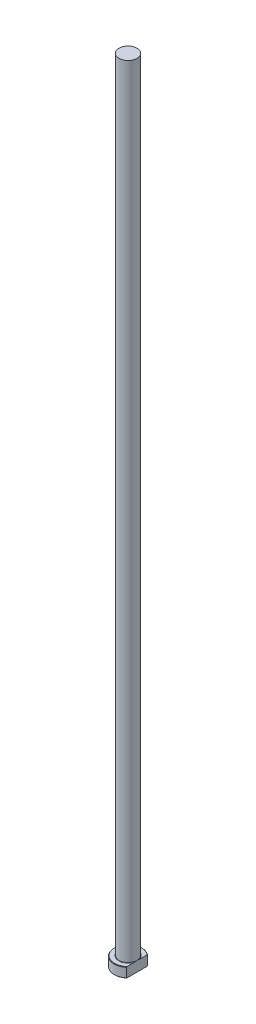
ISO-10303-21;
HEADER;
FILE_DESCRIPTION(('STEP AP214'),'2;1');
FILE_NAME('part.step','',(''),(''),'','','');
FILE_SCHEMA(('AUTOMOTIVE_DESIGN { 1 0 10303 214 1 1 1 1 }'));
ENDSEC;
DATA;
#1=APPLICATION_CONTEXT('core data for automotive mechanical design processes');
#2=APPLICATION_PROTOCOL_DEFINITION('international standard','automotive_design',2000,#1);
#3=PRODUCT_CONTEXT('',#1,'mechanical');
#4=PRODUCT('Part','Part','',(#3));
#5=PRODUCT_RELATED_PRODUCT_CATEGORY('part','',(#4));
#6=PRODUCT_DEFINITION_FORMATION('','',#4);
#7=PRODUCT_DEFINITION_CONTEXT('part definition',#1,'design');
#8=PRODUCT_DEFINITION('design','',#6,#7);
#9=PRODUCT_DEFINITION_SHAPE('','',#8);
#10=(LENGTH_UNIT() NAMED_UNIT(*) SI_UNIT(.MILLI.,.METRE.));
#11=(NAMED_UNIT(*) PLANE_ANGLE_UNIT() SI_UNIT($,.RADIAN.));
#12=(NAMED_UNIT(*) SI_UNIT($,.STERADIAN.) SOLID_ANGLE_UNIT());
#13=UNCERTAINTY_MEASURE_WITH_UNIT(LENGTH_MEASURE(1.E-05),#10,'distance_accuracy_value','');
#14=(GEOMETRIC_REPRESENTATION_CONTEXT(3) GLOBAL_UNCERTAINTY_ASSIGNED_CONTEXT((#13)) GLOBAL_UNIT_ASSIGNED_CONTEXT((#10,
#11,#12)) REPRESENTATION_CONTEXT('',''));
#15=CARTESIAN_POINT('',(0.,0.,0.));
#16=DIRECTION('',(0.,0.,1.));
#17=DIRECTION('',(1.,0.,0.));
#18=AXIS2_PLACEMENT_3D('',#15,#16,#17);
#19=CARTESIAN_POINT('',(0.,0.,0.));
#20=DIRECTION('',(0.,-1.,0.));
#21=DIRECTION('',(0.,0.,-1.));
#22=AXIS2_PLACEMENT_3D('',#19,#20,#21);
#23=PLANE('',#22);
#24=CARTESIAN_POINT('',(0.,0.,0.));
#25=DIRECTION('',(0.,-1.,0.));
#26=DIRECTION('',(0.,0.,-1.));
#27=AXIS2_PLACEMENT_3D('',#24,#25,#26);
#28=CIRCLE('',#27,6.79999999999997);
#29=CARTESIAN_POINT('',(4.49999999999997,0.,5.09803883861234));
#30=VERTEX_POINT('',#29);
#31=CARTESIAN_POINT('',(4.49999999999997,0.,-5.09803883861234));
#32=VERTEX_POINT('',#31);
#33=EDGE_CURVE('E98',#30,#32,#28,.T.);
#34=ORIENTED_EDGE('',*,*,#33,.T.);
#35=DIRECTION('',(0.,0.,1.));
#36=VECTOR('',#35,1.);
#37=CARTESIAN_POINT('',(4.49999999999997,0.,-5.36190264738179));
#38=LINE('',#37,#36);
#39=EDGE_CURVE('E83',#32,#30,#38,.T.);
#40=ORIENTED_EDGE('',*,*,#39,.T.);
#41=EDGE_LOOP('',(#34,#40));
#42=FACE_BOUND('',#41,.T.);
#43=ADVANCED_FACE('F32',(#42),#23,.T.);
#44=CARTESIAN_POINT('',(0.,259.958771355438,0.));
#45=DIRECTION('',(0.,1.,0.));
#46=DIRECTION('',(0.,0.,1.));
#47=AXIS2_PLACEMENT_3D('',#44,#45,#46);
#48=CYLINDRICAL_SURFACE('',#47,6.99999999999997);
#49=CARTESIAN_POINT('',(0.,4.80000000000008,0.));
#50=DIRECTION('',(0.,1.,0.));
#51=DIRECTION('',(0.,0.,1.));
#52=AXIS2_PLACEMENT_3D('',#49,#50,#51);
#53=CIRCLE('',#52,6.99999999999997);
#54=CARTESIAN_POINT('',(4.49999999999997,4.80000000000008,5.36190264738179));
#55=VERTEX_POINT('',#54);
#56=CARTESIAN_POINT('',(4.49999999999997,4.80000000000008,-5.36190264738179));
#57=VERTEX_POINT('',#56);
#58=EDGE_CURVE('E104',#55,#57,#53,.F.);
#59=ORIENTED_EDGE('',*,*,#58,.T.);
#60=DIRECTION('',(0.,-1.,0.));
#61=VECTOR('',#60,1.);
#62=CARTESIAN_POINT('',(4.49999999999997,400.,-5.36190264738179));
#63=LINE('',#62,#61);
#64=CARTESIAN_POINT('',(4.49999999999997,0.199999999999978,-5.36190264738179));
#65=VERTEX_POINT('',#64);
#66=EDGE_CURVE('E183',#57,#65,#63,.T.);
#67=ORIENTED_EDGE('',*,*,#66,.T.);
#68=CARTESIAN_POINT('',(0.,0.199999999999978,0.));
#69=DIRECTION('',(0.,-1.,0.));
#70=DIRECTION('',(0.,0.,-1.));
#71=AXIS2_PLACEMENT_3D('',#68,#69,#70);
#72=CIRCLE('',#71,6.99999999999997);
#73=CARTESIAN_POINT('',(4.49999999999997,0.199999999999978,5.36190264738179));
#74=VERTEX_POINT('',#73);
#75=EDGE_CURVE('E100',#65,#74,#72,.F.);
#76=ORIENTED_EDGE('',*,*,#75,.T.);
#77=DIRECTION('',(0.,-1.,0.));
#78=VECTOR('',#77,1.);
#79=CARTESIAN_POINT('',(4.49999999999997,400.,5.36190264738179));
#80=LINE('',#79,#78);
#81=EDGE_CURVE('E93',#55,#74,#80,.T.);
#82=ORIENTED_EDGE('',*,*,#81,.F.);
#83=EDGE_LOOP('',(#59,#67,#76,#82));
#84=FACE_BOUND('',#83,.T.);
#85=ADVANCED_FACE('F158',(#84),#48,.T.);
#86=CARTESIAN_POINT('',(-6.99999999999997,5.,0.));
#87=DIRECTION('',(0.,1.,0.));
#88=DIRECTION('',(0.,0.,1.));
#89=AXIS2_PLACEMENT_3D('',#86,#87,#88);
#90=PLANE('',#89);
#91=CARTESIAN_POINT('',(0.,5.,0.));
#92=DIRECTION('',(0.,1.,0.));
#93=DIRECTION('',(0.,0.,1.));
#94=AXIS2_PLACEMENT_3D('',#91,#92,#93);
#95=CIRCLE('',#94,6.80000000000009);
#96=CARTESIAN_POINT('',(4.49999999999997,5.,-5.0980388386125));
#97=VERTEX_POINT('',#96);
#98=CARTESIAN_POINT('',(4.49999999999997,5.,5.0980388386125));
#99=VERTEX_POINT('',#98);
#100=EDGE_CURVE('E178',#97,#99,#95,.T.);
#101=ORIENTED_EDGE('',*,*,#100,.T.);
#102=DIRECTION('',(0.,0.,-1.));
#103=VECTOR('',#102,1.);
#104=CARTESIAN_POINT('',(4.49999999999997,5.,0.));
#105=LINE('',#104,#103);
#106=CARTESIAN_POINT('',(4.49999999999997,4.99999999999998,1.35646599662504));
#107=VERTEX_POINT('',#106);
#108=EDGE_CURVE('E57',#99,#107,#105,.T.);
#109=ORIENTED_EDGE('',*,*,#108,.T.);
#110=CARTESIAN_POINT('',(0.,5.,0.));
#111=DIRECTION('',(0.,1.,0.));
#112=DIRECTION('',(0.,0.,1.));
#113=AXIS2_PLACEMENT_3D('',#110,#111,#112);
#114=CIRCLE('',#113,4.69999999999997);
#115=CARTESIAN_POINT('',(4.49999999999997,4.99999999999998,-1.35646599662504));
#116=VERTEX_POINT('',#115);
#117=EDGE_CURVE('E107',#107,#116,#114,.F.);
#118=ORIENTED_EDGE('',*,*,#117,.T.);
#119=EDGE_CURVE('E136',#116,#97,#105,.T.);
#120=ORIENTED_EDGE('',*,*,#119,.T.);
#121=EDGE_LOOP('',(#101,#109,#118,#120));
#122=FACE_BOUND('',#121,.T.);
#123=ADVANCED_FACE('F147',(#122),#90,.T.);
#124=CARTESIAN_POINT('',(0.,5.,0.));
#125=DIRECTION('',(0.,-1.,0.));
#126=DIRECTION('',(0.,0.,-1.));
#127=AXIS2_PLACEMENT_3D('',#124,#125,#126);
#128=CONICAL_SURFACE('',#127,6.80000000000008,0.785398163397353);
#129=ORIENTED_EDGE('',*,*,#58,.F.);
#130=CARTESIAN_POINT('',(4.49999999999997,-0.826603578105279,11.7975047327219));
#131=CARTESIAN_POINT('',(4.49999999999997,-0.6565338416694,11.6154797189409));
#132=CARTESIAN_POINT('',(4.49999999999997,-0.486727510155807,11.4332086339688));
#133=CARTESIAN_POINT('',(4.49999999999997,-0.147726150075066,11.0680967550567));
#134=CARTESIAN_POINT('',(4.49999999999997,0.0214688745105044,10.8852559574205));
#135=CARTESIAN_POINT('',(4.49999999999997,0.528086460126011,10.3356799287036));
#136=CARTESIAN_POINT('',(4.49999999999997,0.864461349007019,9.96797672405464));
#137=CARTESIAN_POINT('',(4.49999999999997,1.5359242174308,9.22638843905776));
#138=CARTESIAN_POINT('',(4.49999999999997,1.87098392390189,8.85247771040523));
#139=CARTESIAN_POINT('',(4.49999999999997,2.53567264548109,8.09993899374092));
#140=CARTESIAN_POINT('',(4.49999999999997,2.86530243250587,7.72131168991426));
#141=CARTESIAN_POINT('',(4.49999999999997,3.45461987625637,7.03004475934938));
#142=CARTESIAN_POINT('',(4.49999999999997,3.7156705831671,6.71857295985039));
#143=CARTESIAN_POINT('',(4.49999999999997,4.10171222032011,6.24673895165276));
#144=CARTESIAN_POINT('',(4.49999999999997,4.22949330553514,6.08866046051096));
#145=CARTESIAN_POINT('',(4.49999999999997,4.48278285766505,5.77069538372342));
#146=CARTESIAN_POINT('',(4.49999999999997,4.60829137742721,5.61080884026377));
#147=CARTESIAN_POINT('',(4.49999999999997,4.85630566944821,5.28917357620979));
#148=CARTESIAN_POINT('',(4.49999999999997,4.97881640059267,5.12742868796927));
#149=CARTESIAN_POINT('',(4.49999999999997,5.22038566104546,4.80138722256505));
#150=CARTESIAN_POINT('',(4.49999999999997,5.33944438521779,4.63709079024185));
#151=CARTESIAN_POINT('',(4.49999999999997,5.57315514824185,4.3055112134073));
#152=CARTESIAN_POINT('',(4.49999999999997,5.68780947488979,4.13822968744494));
#153=CARTESIAN_POINT('',(4.49999999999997,5.91154779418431,3.79999593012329));
#154=CARTESIAN_POINT('',(4.49999999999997,6.02063265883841,3.62904427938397));
#155=CARTESIAN_POINT('',(4.49999999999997,6.21658595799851,3.3073226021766));
#156=CARTESIAN_POINT('',(4.49999999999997,6.30440873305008,3.15713645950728));
#157=CARTESIAN_POINT('',(4.49999999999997,6.47332532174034,2.85297503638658));
#158=CARTESIAN_POINT('',(4.49999999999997,6.55441838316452,2.69899933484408));
#159=CARTESIAN_POINT('',(4.49999999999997,6.70797622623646,2.38687180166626));
#160=CARTESIAN_POINT('',(4.49999999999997,6.78044573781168,2.22872231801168));
#161=CARTESIAN_POINT('',(4.49999999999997,6.9144511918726,1.90783021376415));
#162=CARTESIAN_POINT('',(4.49999999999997,6.97598991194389,1.74508877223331));
#163=CARTESIAN_POINT('',(4.49999999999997,7.07411688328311,1.44888794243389));
#164=CARTESIAN_POINT('',(4.49999999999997,7.11323376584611,1.3162713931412));
#165=CARTESIAN_POINT('',(4.49999999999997,7.18128524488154,1.04846462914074));
#166=CARTESIAN_POINT('',(4.49999999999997,7.21022354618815,0.913275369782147));
#167=CARTESIAN_POINT('',(4.49999999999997,7.25649613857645,0.641333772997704));
#168=CARTESIAN_POINT('',(4.49999999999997,7.27386660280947,0.504587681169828));
#169=CARTESIAN_POINT('',(4.49999999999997,7.29619809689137,0.230076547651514));
#170=CARTESIAN_POINT('',(4.49999999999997,7.301159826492,0.0923115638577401));
#171=CARTESIAN_POINT('',(4.49999999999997,7.29837868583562,-0.183455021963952));
#172=CARTESIAN_POINT('',(4.49999999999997,7.29060196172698,-0.321456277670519));
#173=CARTESIAN_POINT('',(4.49999999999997,7.26273607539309,-0.596199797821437));
#174=CARTESIAN_POINT('',(4.49999999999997,7.24264594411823,-0.732941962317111));
#175=CARTESIAN_POINT('',(4.49999999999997,7.19114637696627,-1.00468961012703));
#176=CARTESIAN_POINT('',(4.49999999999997,7.15970172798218,-1.13968832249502));
#177=CARTESIAN_POINT('',(4.49999999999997,7.08693261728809,-1.40696616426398));
#178=CARTESIAN_POINT('',(4.49999999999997,7.04560769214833,-1.53924516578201));
#179=CARTESIAN_POINT('',(4.49999999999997,6.94926301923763,-1.8161559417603));
#180=CARTESIAN_POINT('',(4.49999999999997,6.89320710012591,-1.96042418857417));
#181=CARTESIAN_POINT('',(4.49999999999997,6.77257673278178,-2.24536359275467));
#182=CARTESIAN_POINT('',(4.49999999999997,6.70799968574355,-2.38603363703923));
#183=CARTESIAN_POINT('',(4.49999999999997,6.57186656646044,-2.66422978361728));
#184=CARTESIAN_POINT('',(4.49999999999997,6.50029866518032,-2.80175005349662));
#185=CARTESIAN_POINT('',(4.49999999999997,6.35162424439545,-3.07372108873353));
#186=CARTESIAN_POINT('',(4.49999999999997,6.27451843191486,-3.20817224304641));
#187=CARTESIAN_POINT('',(4.49999999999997,6.11478562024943,-3.47611571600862));
#188=CARTESIAN_POINT('',(4.49999999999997,6.03209988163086,-3.60957285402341));
#189=CARTESIAN_POINT('',(4.49999999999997,5.86298040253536,-3.87408571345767));
#190=CARTESIAN_POINT('',(4.49999999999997,5.7765465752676,-4.00514137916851));
#191=CARTESIAN_POINT('',(4.49999999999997,5.6006924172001,-4.26503919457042));
#192=CARTESIAN_POINT('',(4.49999999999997,5.51127511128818,-4.39388339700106));
#193=CARTESIAN_POINT('',(4.49999999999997,5.32990145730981,-4.64976494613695));
#194=CARTESIAN_POINT('',(4.49999999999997,5.23794514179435,-4.77680231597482));
#195=CARTESIAN_POINT('',(4.49999999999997,5.02845923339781,-5.06114674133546));
#196=CARTESIAN_POINT('',(4.49999999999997,4.91032759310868,-5.2180097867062));
#197=CARTESIAN_POINT('',(4.49999999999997,4.67137262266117,-5.52967502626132));
#198=CARTESIAN_POINT('',(4.49999999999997,4.55054918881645,-5.68447714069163));
#199=CARTESIAN_POINT('',(4.49999999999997,4.18476750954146,-6.14632269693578));
#200=CARTESIAN_POINT('',(4.49999999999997,3.93652718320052,-6.45076612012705));
#201=CARTESIAN_POINT('',(4.49999999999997,3.4337584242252,-7.05492264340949));
#202=CARTESIAN_POINT('',(4.49999999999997,3.17922364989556,-7.35463042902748));
#203=CARTESIAN_POINT('',(4.49999999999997,2.66577175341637,-7.9502768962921));
#204=CARTESIAN_POINT('',(4.49999999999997,2.40685449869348,-8.24621546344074));
#205=CARTESIAN_POINT('',(4.49999999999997,1.90253774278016,-8.81624717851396));
#206=CARTESIAN_POINT('',(4.49999999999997,1.65734104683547,-9.09052019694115));
#207=CARTESIAN_POINT('',(4.49999999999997,1.1647221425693,-9.63707062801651));
#208=CARTESIAN_POINT('',(4.49999999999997,0.917299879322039,-9.90934799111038));
#209=CARTESIAN_POINT('',(4.49999999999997,0.421259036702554,-10.4516873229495));
#210=CARTESIAN_POINT('',(4.49999999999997,0.172644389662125,-10.721752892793));
#211=CARTESIAN_POINT('',(4.49999999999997,-0.325997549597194,-11.2605533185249));
#212=CARTESIAN_POINT('',(4.49999999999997,-0.576024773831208,-11.5292882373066));
#213=CARTESIAN_POINT('',(4.49999999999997,-0.82660357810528,-11.7975047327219));
#214=B_SPLINE_CURVE_WITH_KNOTS('',3,(#130,#131,#132,#133,#134,#135,#136,#137,#138,#139,#140,
#141,#142,#143,#144,#145,#146,#147,#148,#149,#150,#151,#152,#153,#154,#155,#156,#157,#158,#159,
#160,#161,#162,#163,#164,#165,#166,#167,#168,#169,#170,#171,#172,#173,#174,#175,#176,#177,#178,
#179,#180,#181,#182,#183,#184,#185,#186,#187,#188,#189,#190,#191,#192,#193,#194,#195,#196,#197,
#198,#199,#200,#201,#202,#203,#204,#205,#206,#207,#208,#209,#210,#211,#212,#213),.UNSPECIFIED.,
.F.,.F.,(4,2,2,2,2,2,2,2,2,2,2,2,2,2,2,2,2,2,2,2,2,2,2,2,2,2,2,2,2,2,2,2,2,2,2,2,2,2,2,2,2,4),
(0.,0.747335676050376,1.49467621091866,2.98970927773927,4.4958841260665,6.00184297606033,
7.22095514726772,7.83073509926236,8.44050085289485,9.04917844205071,9.65782160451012,
10.2661442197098,10.8743712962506,11.3961742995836,11.9180355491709,12.439609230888,
12.9610501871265,13.3755059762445,13.7898107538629,14.2028138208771,14.6157935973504,
15.0298726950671,15.4439843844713,15.8593915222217,16.2748181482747,16.738805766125,
17.2029352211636,17.6678640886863,18.1327337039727,18.6036459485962,19.0745691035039,
19.5450285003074,20.0154818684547,20.604553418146,21.1936476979,22.3719830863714,
23.5515583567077,24.7311693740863,25.8348416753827,26.9385412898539,28.0397632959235,
29.1409327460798),.UNSPECIFIED.);
#215=EDGE_CURVE('E135',#55,#99,#214,.T.);
#216=ORIENTED_EDGE('',*,*,#215,.T.);
#217=ORIENTED_EDGE('',*,*,#100,.F.);
#218=EDGE_CURVE('E127',#97,#57,#214,.T.);
#219=ORIENTED_EDGE('',*,*,#218,.T.);
#220=EDGE_LOOP('',(#129,#216,#217,#219));
#221=FACE_BOUND('',#220,.T.);
#222=ADVANCED_FACE('F143',(#221),#128,.T.);
#223=CARTESIAN_POINT('',(0.,0.199999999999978,0.));
#224=DIRECTION('',(0.,1.,0.));
#225=DIRECTION('',(0.,0.,1.));
#226=AXIS2_PLACEMENT_3D('',#223,#224,#225);
#227=CONICAL_SURFACE('',#226,6.99999999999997,0.785398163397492);
#228=ORIENTED_EDGE('',*,*,#75,.F.);
#229=CARTESIAN_POINT('',(4.49999999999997,5.82660357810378,-11.7975047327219));
#230=CARTESIAN_POINT('',(4.49999999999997,5.65653384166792,-11.6154797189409));
#231=CARTESIAN_POINT('',(4.49999999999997,5.48672751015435,-11.4332086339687));
#232=CARTESIAN_POINT('',(4.49999999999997,5.14772615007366,-11.0680967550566));
#233=CARTESIAN_POINT('',(4.49999999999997,4.97853112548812,-10.8852559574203));
#234=CARTESIAN_POINT('',(4.49999999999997,4.47191353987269,-10.3356799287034));
#235=CARTESIAN_POINT('',(4.49999999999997,4.13553865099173,-9.96797672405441));
#236=CARTESIAN_POINT('',(4.49999999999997,3.46407578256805,-9.22638843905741));
#237=CARTESIAN_POINT('',(4.49999999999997,3.12901607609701,-8.85247771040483));
#238=CARTESIAN_POINT('',(4.49999999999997,2.46432735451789,-8.09993899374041));
#239=CARTESIAN_POINT('',(4.49999999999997,2.13469756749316,-7.72131168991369));
#240=CARTESIAN_POINT('',(4.49999999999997,1.54538012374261,-7.03004475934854));
#241=CARTESIAN_POINT('',(4.49999999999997,1.28432941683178,-6.71857295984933));
#242=CARTESIAN_POINT('',(4.49999999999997,0.898287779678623,-6.24673895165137));
#243=CARTESIAN_POINT('',(4.49999999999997,0.770506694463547,-6.08866046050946));
#244=CARTESIAN_POINT('',(4.49999999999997,0.517217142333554,-5.77069538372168));
#245=CARTESIAN_POINT('',(4.49999999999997,0.391708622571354,-5.61080884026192));
#246=CARTESIAN_POINT('',(4.49999999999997,0.143694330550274,-5.28917357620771));
#247=CARTESIAN_POINT('',(4.49999999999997,0.0211835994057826,-5.12742868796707));
#248=CARTESIAN_POINT('',(4.49999999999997,-0.220385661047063,-4.80138722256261));
#249=CARTESIAN_POINT('',(4.49999999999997,-0.339444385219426,-4.63709079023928));
#250=CARTESIAN_POINT('',(4.49999999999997,-0.573155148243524,-4.30551121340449));
#251=CARTESIAN_POINT('',(4.49999999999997,-0.687809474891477,-4.138229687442));
#252=CARTESIAN_POINT('',(4.49999999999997,-0.911547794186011,-3.79999593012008));
#253=CARTESIAN_POINT('',(4.49999999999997,-1.02063265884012,-3.62904427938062));
#254=CARTESIAN_POINT('',(4.49999999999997,-1.21658595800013,-3.30732260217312));
#255=CARTESIAN_POINT('',(4.49999999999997,-1.30440873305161,-3.15713645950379));
#256=CARTESIAN_POINT('',(4.49999999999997,-1.4733253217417,-2.85297503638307));
#257=CARTESIAN_POINT('',(4.49999999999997,-1.55441838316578,-2.69899933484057));
#258=CARTESIAN_POINT('',(4.49999999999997,-1.70797622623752,-2.38687180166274));
#259=CARTESIAN_POINT('',(4.49999999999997,-1.78044573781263,-2.22872231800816));
#260=CARTESIAN_POINT('',(4.49999999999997,-1.91445119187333,-1.90783021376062));
#261=CARTESIAN_POINT('',(4.49999999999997,-1.97598991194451,-1.74508877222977));
#262=CARTESIAN_POINT('',(4.49999999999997,-2.0741168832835,-1.44888794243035));
#263=CARTESIAN_POINT('',(4.49999999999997,-2.1132337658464,-1.31627139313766));
#264=CARTESIAN_POINT('',(4.49999999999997,-2.18128524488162,-1.04846462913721));
#265=CARTESIAN_POINT('',(4.49999999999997,-2.21022354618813,-0.913275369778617));
#266=CARTESIAN_POINT('',(4.49999999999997,-2.2564961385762,-0.641333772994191));
#267=CARTESIAN_POINT('',(4.49999999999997,-2.27386660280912,-0.504587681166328));
#268=CARTESIAN_POINT('',(4.49999999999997,-2.29619809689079,-0.230076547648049));
#269=CARTESIAN_POINT('',(4.49999999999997,-2.30115982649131,-0.0923115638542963));
#270=CARTESIAN_POINT('',(4.49999999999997,-2.29837868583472,0.183455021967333));
#271=CARTESIAN_POINT('',(4.49999999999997,-2.29060196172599,0.32145627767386));
#272=CARTESIAN_POINT('',(4.49999999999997,-2.26273607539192,0.596199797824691));
#273=CARTESIAN_POINT('',(4.49999999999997,-2.24264594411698,0.732941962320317));
#274=CARTESIAN_POINT('',(4.49999999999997,-2.19114637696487,1.00468961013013));
#275=CARTESIAN_POINT('',(4.49999999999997,-2.15970172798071,1.13968832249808));
#276=CARTESIAN_POINT('',(4.49999999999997,-2.08693261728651,1.40696616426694));
#277=CARTESIAN_POINT('',(4.49999999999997,-2.04560769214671,1.53924516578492));
#278=CARTESIAN_POINT('',(4.49999999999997,-1.9492630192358,1.81615594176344));
#279=CARTESIAN_POINT('',(4.49999999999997,-1.89320710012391,1.96042418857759));
#280=CARTESIAN_POINT('',(4.49999999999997,-1.77257673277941,2.24536359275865));
#281=CARTESIAN_POINT('',(4.49999999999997,-1.70799968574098,2.38603363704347));
#282=CARTESIAN_POINT('',(4.49999999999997,-1.57186656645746,2.66422978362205));
#283=CARTESIAN_POINT('',(4.49999999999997,-1.50029866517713,2.80175005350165));
#284=CARTESIAN_POINT('',(4.49999999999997,-1.35162424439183,3.07372108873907));
#285=CARTESIAN_POINT('',(4.49999999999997,-1.27451843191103,3.20817224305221));
#286=CARTESIAN_POINT('',(4.49999999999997,-1.11478562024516,3.47611571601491));
#287=CARTESIAN_POINT('',(4.49999999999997,-1.03209988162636,3.60957285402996));
#288=CARTESIAN_POINT('',(4.49999999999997,-0.862980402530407,3.87408571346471));
#289=CARTESIAN_POINT('',(4.49999999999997,-0.77654657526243,4.0051413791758));
#290=CARTESIAN_POINT('',(4.49999999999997,-0.600692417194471,4.26503919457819));
#291=CARTESIAN_POINT('',(4.49999999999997,-0.511275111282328,4.39388339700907));
#292=CARTESIAN_POINT('',(4.49999999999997,-0.329901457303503,4.64976494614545));
#293=CARTESIAN_POINT('',(4.49999999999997,-0.237945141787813,4.77680231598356));
#294=CARTESIAN_POINT('',(4.49999999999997,-0.0284592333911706,5.06114674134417));
#295=CARTESIAN_POINT('',(4.49999999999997,0.0896724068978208,5.21800978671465));
#296=CARTESIAN_POINT('',(4.49999999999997,0.32862737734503,5.52967502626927));
#297=CARTESIAN_POINT('',(4.49999999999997,0.449450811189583,5.68447714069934));
#298=CARTESIAN_POINT('',(4.49999999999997,0.815232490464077,6.14632269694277));
#299=CARTESIAN_POINT('',(4.49999999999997,1.06347281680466,6.45076612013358));
#300=CARTESIAN_POINT('',(4.49999999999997,1.56624157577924,7.05492264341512));
#301=CARTESIAN_POINT('',(4.49999999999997,1.82077635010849,7.35463042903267));
#302=CARTESIAN_POINT('',(4.49999999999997,2.33422824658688,7.95027689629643));
#303=CARTESIAN_POINT('',(4.49999999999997,2.59314550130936,8.24621546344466));
#304=CARTESIAN_POINT('',(4.49999999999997,3.09746225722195,8.81624717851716));
#305=CARTESIAN_POINT('',(4.49999999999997,3.34265895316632,9.09052019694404));
#306=CARTESIAN_POINT('',(4.49999999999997,3.83527785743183,9.63707062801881));
#307=CARTESIAN_POINT('',(4.49999999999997,4.08270012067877,9.90934799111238));
#308=CARTESIAN_POINT('',(4.49999999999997,4.5787409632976,10.451687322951));
#309=CARTESIAN_POINT('',(4.49999999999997,4.8273556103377,10.7217528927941));
#310=CARTESIAN_POINT('',(4.49999999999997,5.32599754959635,11.2605533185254));
#311=CARTESIAN_POINT('',(4.49999999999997,5.57602477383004,11.5292882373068));
#312=CARTESIAN_POINT('',(4.49999999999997,5.82660357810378,11.7975047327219));
#313=B_SPLINE_CURVE_WITH_KNOTS('',3,(#229,#230,#231,#232,#233,#234,#235,#236,#237,#238,#239,
#240,#241,#242,#243,#244,#245,#246,#247,#248,#249,#250,#251,#252,#253,#254,#255,#256,#257,#258,
#259,#260,#261,#262,#263,#264,#265,#266,#267,#268,#269,#270,#271,#272,#273,#274,#275,#276,#277,
#278,#279,#280,#281,#282,#283,#284,#285,#286,#287,#288,#289,#290,#291,#292,#293,#294,#295,#296,
#297,#298,#299,#300,#301,#302,#303,#304,#305,#306,#307,#308,#309,#310,#311,#312),.UNSPECIFIED.,
.F.,.F.,(4,2,2,2,2,2,2,2,2,2,2,2,2,2,2,2,2,2,2,2,2,2,2,2,2,2,2,2,2,2,2,2,2,2,2,2,2,2,2,2,2,4),
(0.,0.747335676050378,1.49467621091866,2.98970927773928,4.49588412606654,6.0018429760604,
7.22095514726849,7.83073509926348,8.44050085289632,9.04917844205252,9.65782160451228,
10.2661442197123,10.8743712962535,11.3961742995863,11.9180355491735,12.4396092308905,
12.9610501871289,13.3755059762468,13.7898107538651,14.2028138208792,14.6157935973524,
15.029872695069,15.4439843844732,15.8593915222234,16.2748181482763,16.7388057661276,
17.2029352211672,17.6678640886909,18.1327337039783,18.6036459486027,19.0745691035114,
19.5450285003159,20.0154818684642,20.6045534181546,21.1936476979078,22.3719830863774,
23.551558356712,24.7311693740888,25.8348416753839,26.9385412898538,28.0397632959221,
29.1409327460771),.UNSPECIFIED.);
#314=EDGE_CURVE('E86',#65,#32,#313,.T.);
#315=ORIENTED_EDGE('',*,*,#314,.T.);
#316=ORIENTED_EDGE('',*,*,#33,.F.);
#317=EDGE_CURVE('E89',#30,#74,#313,.T.);
#318=ORIENTED_EDGE('',*,*,#317,.T.);
#319=EDGE_LOOP('',(#228,#315,#316,#318));
#320=FACE_BOUND('',#319,.T.);
#321=ADVANCED_FACE('F97',(#320),#227,.T.);
#322=CARTESIAN_POINT('',(0.,5.19999999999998,0.));
#323=DIRECTION('',(0.,1.,0.));
#324=DIRECTION('',(0.,0.,1.));
#325=AXIS2_PLACEMENT_3D('',#322,#323,#324);
#326=TOROIDAL_SURFACE('',#325,4.69999999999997,0.2);
#327=CARTESIAN_POINT('',(4.49999999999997,5.19999999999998,0.));
#328=CARTESIAN_POINT('',(4.49999999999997,5.20000055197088,-6.82190207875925E-09));
#329=CARTESIAN_POINT('',(4.49999999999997,5.20000110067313,-2.8507749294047E-07));
#330=CARTESIAN_POINT('',(4.49999999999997,5.20000211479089,-1.011869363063E-06));
#331=CARTESIAN_POINT('',(4.49999999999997,5.20000255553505,-1.47962814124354E-06));
#332=CARTESIAN_POINT('',(4.49999999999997,5.20000349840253,-2.60944744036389E-06));
#333=CARTESIAN_POINT('',(4.49999999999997,5.2000039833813,-3.28932128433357E-06));
#334=CARTESIAN_POINT('',(4.49999999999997,5.20000482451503,-4.67191774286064E-06));
#335=CARTESIAN_POINT('',(4.49999999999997,5.20000518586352,-5.37183781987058E-06));
#336=CARTESIAN_POINT('',(4.49999999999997,5.2000065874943,-8.170073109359E-06));
#337=CARTESIAN_POINT('',(4.49999999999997,5.2000075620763,-1.03053692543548E-05));
#338=CARTESIAN_POINT('',(4.49999999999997,5.20000909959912,-1.44577153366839E-05));
#339=CARTESIAN_POINT('',(4.49999999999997,5.20000969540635,-1.64630059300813E-05));
#340=CARTESIAN_POINT('',(4.49999999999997,5.20001228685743,-2.51554967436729E-05));
#341=CARTESIAN_POINT('',(4.49999999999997,5.20001430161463,-3.18381715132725E-05));
#342=CARTESIAN_POINT('',(4.49999999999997,5.20001716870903,-4.42838289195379E-05));
#343=CARTESIAN_POINT('',(4.49999999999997,5.20001815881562,-5.00144685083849E-05));
#344=CARTESIAN_POINT('',(4.49999999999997,5.20002543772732,-9.26835273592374E-05));
#345=CARTESIAN_POINT('',(4.49999999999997,5.20003122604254,-0.000129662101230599));
#346=CARTESIAN_POINT('',(4.49999999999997,5.20005596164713,-0.000272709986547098));
#347=CARTESIAN_POINT('',(4.49999999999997,5.20007919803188,-0.00037804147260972));
#348=CARTESIAN_POINT('',(4.49999999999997,5.20016600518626,-0.000777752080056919));
#349=CARTESIAN_POINT('',(4.49999999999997,5.2002271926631,-0.00107246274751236));
#350=CARTESIAN_POINT('',(4.49999999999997,5.20046266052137,-0.00220073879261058));
#351=CARTESIAN_POINT('',(4.49999999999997,5.20063910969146,-0.00303403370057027));
#352=CARTESIAN_POINT('',(4.49999999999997,5.20146807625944,-0.00695397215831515));
#353=CARTESIAN_POINT('',(4.49999999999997,5.20211775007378,-0.0100409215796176));
#354=CARTESIAN_POINT('',(4.49999999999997,5.2104625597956,-0.0496851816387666));
#355=CARTESIAN_POINT('',(4.49999999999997,5.2181721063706,-0.0862414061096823));
#356=CARTESIAN_POINT('',(4.49999999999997,5.23425793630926,-0.163016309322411));
#357=CARTESIAN_POINT('',(4.49999999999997,5.24262411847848,-0.203237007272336));
#358=CARTESIAN_POINT('',(4.49999999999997,5.25647489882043,-0.270691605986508));
#359=CARTESIAN_POINT('',(4.49999999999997,5.26201543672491,-0.297913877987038));
#360=CARTESIAN_POINT('',(4.49999999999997,5.27283497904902,-0.351731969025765));
#361=CARTESIAN_POINT('',(4.49999999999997,5.27811706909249,-0.378327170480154));
#362=CARTESIAN_POINT('',(4.49999999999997,5.29540054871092,-0.466700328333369));
#363=CARTESIAN_POINT('',(4.49999999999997,5.30706090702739,-0.528546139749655));
#364=CARTESIAN_POINT('',(4.49999999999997,5.32919553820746,-0.652993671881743));
#365=CARTESIAN_POINT('',(4.49999999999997,5.33965890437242,-0.715597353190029));
#366=CARTESIAN_POINT('',(4.49999999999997,5.35981150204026,-0.848050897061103));
#367=CARTESIAN_POINT('',(4.49999999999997,5.36928619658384,-0.917934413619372));
#368=CARTESIAN_POINT('',(4.49999999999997,5.38501179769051,-1.05789403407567));
#369=CARTESIAN_POINT('',(4.49999999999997,5.39127087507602,-1.12796919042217));
#370=CARTESIAN_POINT('',(4.49999999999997,5.39912931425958,-1.26576099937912));
#371=CARTESIAN_POINT('',(4.49999999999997,5.40089657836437,-1.33346617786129));
#372=CARTESIAN_POINT('',(4.49999999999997,5.39892238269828,-1.43427893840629));
#373=CARTESIAN_POINT('',(4.49999999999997,5.39752994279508,-1.46742827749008));
#374=CARTESIAN_POINT('',(4.49999999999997,5.39286046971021,-1.53357775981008));
#375=CARTESIAN_POINT('',(4.49999999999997,5.38958468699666,-1.56657798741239));
#376=CARTESIAN_POINT('',(4.49999999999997,5.38053340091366,-1.63263406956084));
#377=CARTESIAN_POINT('',(4.49999999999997,5.37473096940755,-1.66568659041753));
#378=CARTESIAN_POINT('',(4.49999999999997,5.363351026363,-1.71471614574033));
#379=CARTESIAN_POINT('',(4.49999999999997,5.35910046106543,-1.73099981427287));
#380=CARTESIAN_POINT('',(4.49999999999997,5.34948134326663,-1.76322922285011));
#381=CARTESIAN_POINT('',(4.49999999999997,5.34411369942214,-1.77917522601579));
#382=CARTESIAN_POINT('',(4.49999999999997,5.33191498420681,-1.81057972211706));
#383=CARTESIAN_POINT('',(4.49999999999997,5.32507796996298,-1.82603593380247));
#384=CARTESIAN_POINT('',(4.49999999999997,5.30945990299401,-1.85590044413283));
#385=CARTESIAN_POINT('',(4.49999999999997,5.3006900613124,-1.87031417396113));
#386=CARTESIAN_POINT('',(4.49999999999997,5.28636937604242,-1.88912645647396));
#387=CARTESIAN_POINT('',(4.49999999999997,5.28198345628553,-1.89440539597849));
#388=CARTESIAN_POINT('',(4.49999999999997,5.27265048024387,-1.90446776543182));
#389=CARTESIAN_POINT('',(4.49999999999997,5.26770253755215,-1.90925038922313));
#390=CARTESIAN_POINT('',(4.49999999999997,5.25711045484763,-1.91814546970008));
#391=CARTESIAN_POINT('',(4.49999999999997,5.25145790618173,-1.92224813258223));
#392=CARTESIAN_POINT('',(4.49999999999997,5.23949451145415,-1.92934216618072));
#393=CARTESIAN_POINT('',(4.49999999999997,5.23318629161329,-1.93233776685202));
#394=CARTESIAN_POINT('',(4.49999999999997,5.22225980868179,-1.93605363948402));
#395=CARTESIAN_POINT('',(4.49999999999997,5.21778688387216,-1.93720033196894));
#396=CARTESIAN_POINT('',(4.49999999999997,5.20871133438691,-1.93872266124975));
#397=CARTESIAN_POINT('',(4.49999999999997,5.20410881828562,-1.9390989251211));
#398=CARTESIAN_POINT('',(4.49999999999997,5.19490368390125,-1.939041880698));
#399=CARTESIAN_POINT('',(4.49999999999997,5.19030107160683,-1.93860763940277));
#400=CARTESIAN_POINT('',(4.49999999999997,5.18123418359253,-1.93697295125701));
#401=CARTESIAN_POINT('',(4.49999999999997,5.17677002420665,-1.93577187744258));
#402=CARTESIAN_POINT('',(4.49999999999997,5.1668471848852,-1.93227382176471));
#403=CARTESIAN_POINT('',(4.49999999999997,5.16146458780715,-1.92976289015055));
#404=CARTESIAN_POINT('',(4.49999999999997,5.15117210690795,-1.92391275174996));
#405=CARTESIAN_POINT('',(4.49999999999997,5.1462632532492,-1.92057179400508));
#406=CARTESIAN_POINT('',(4.49999999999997,5.13406500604,-1.91106955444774));
#407=CARTESIAN_POINT('',(4.49999999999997,5.1271509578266,-1.90443135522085));
#408=CARTESIAN_POINT('',(4.49999999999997,5.1143641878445,-1.89022781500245));
#409=CARTESIAN_POINT('',(4.49999999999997,5.10849431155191,-1.88266003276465));
#410=CARTESIAN_POINT('',(4.49999999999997,5.09196345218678,-1.85885313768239));
#411=CARTESIAN_POINT('',(4.49999999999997,5.08260528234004,-1.84172098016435));
#412=CARTESIAN_POINT('',(4.49999999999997,5.0661847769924,-1.80641645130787));
#413=CARTESIAN_POINT('',(4.49999999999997,5.05912924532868,-1.78824118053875));
#414=CARTESIAN_POINT('',(4.49999999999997,5.04323663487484,-1.74113187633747));
#415=CARTESIAN_POINT('',(4.49999999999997,5.03557186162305,-1.7118061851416));
#416=CARTESIAN_POINT('',(4.49999999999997,5.02293045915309,-1.6525641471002));
#417=CARTESIAN_POINT('',(4.49999999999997,5.01795986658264,-1.62264662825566));
#418=CARTESIAN_POINT('',(4.49999999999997,5.01001791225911,-1.56241066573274));
#419=CARTESIAN_POINT('',(4.49999999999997,5.00705603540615,-1.53209099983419));
#420=CARTESIAN_POINT('',(4.49999999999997,5.00272853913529,-1.4713805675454));
#421=CARTESIAN_POINT('',(4.49999999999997,5.00136115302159,-1.44098991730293));
#422=CARTESIAN_POINT('',(4.49999999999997,4.99922532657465,-1.3517640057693));
#423=CARTESIAN_POINT('',(4.49999999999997,5.00021079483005,-1.29288773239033));
#424=CARTESIAN_POINT('',(4.49999999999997,5.00555979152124,-1.17527759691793));
#425=CARTESIAN_POINT('',(4.49999999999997,5.0099258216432,-1.11654387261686));
#426=CARTESIAN_POINT('',(4.49999999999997,5.02118223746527,-0.999199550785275));
#427=CARTESIAN_POINT('',(4.49999999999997,5.02807797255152,-0.940589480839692));
#428=CARTESIAN_POINT('',(4.49999999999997,5.04376271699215,-0.823619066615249));
#429=CARTESIAN_POINT('',(4.49999999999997,5.05255207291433,-0.765258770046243));
#430=CARTESIAN_POINT('',(4.49999999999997,5.08097305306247,-0.59074120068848));
#431=CARTESIAN_POINT('',(4.49999999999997,5.10268261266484,-0.474928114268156));
#432=CARTESIAN_POINT('',(4.49999999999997,5.14864719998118,-0.243827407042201));
#433=CARTESIAN_POINT('',(4.49999999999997,5.1729024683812,-0.128539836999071));
#434=CARTESIAN_POINT('',(4.49999999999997,5.19721381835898,-0.013216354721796));
#435=CARTESIAN_POINT('',(4.49999999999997,5.19722314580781,-0.0131721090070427));
#436=CARTESIAN_POINT('',(4.49999999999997,5.19779043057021,-0.0104809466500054));
#437=CARTESIAN_POINT('',(4.49999999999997,5.19834611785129,-0.00783370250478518));
#438=CARTESIAN_POINT('',(4.49999999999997,5.19915446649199,-0.00401576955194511));
#439=CARTESIAN_POINT('',(4.49999999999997,5.19940338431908,-0.00284453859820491));
#440=CARTESIAN_POINT('',(4.49999999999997,5.19972657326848,-0.00129224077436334));
#441=CARTESIAN_POINT('',(4.49999999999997,5.19980524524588,-0.000911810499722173));
#442=CARTESIAN_POINT('',(4.49999999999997,5.19991316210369,-0.000412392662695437));
#443=CARTESIAN_POINT('',(4.49999999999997,5.199939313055,-0.000292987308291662));
#444=CARTESIAN_POINT('',(4.49999999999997,5.19996676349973,-0.000133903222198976));
#445=CARTESIAN_POINT('',(4.49999999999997,5.19997289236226,-9.50488513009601E-05));
#446=CARTESIAN_POINT('',(4.49999999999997,5.19998085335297,-5.04499399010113E-05));
#447=CARTESIAN_POINT('',(4.49999999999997,5.19998191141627,-4.46245658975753E-05));
#448=CARTESIAN_POINT('',(4.49999999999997,5.19998498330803,-3.19756841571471E-05));
#449=CARTESIAN_POINT('',(4.49999999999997,5.19998714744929,-2.518933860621E-05));
#450=CARTESIAN_POINT('',(4.49999999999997,5.19998992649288,-1.63868871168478E-05));
#451=CARTESIAN_POINT('',(4.49999999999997,5.19999055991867,-1.43745410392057E-05));
#452=CARTESIAN_POINT('',(4.49999999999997,5.19999218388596,-1.02133648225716E-05));
#453=CARTESIAN_POINT('',(4.49999999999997,5.19999320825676,-8.07729849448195E-06));
#454=CARTESIAN_POINT('',(4.49999999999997,5.19999467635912,-5.28414581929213E-06));
#455=CARTESIAN_POINT('',(4.49999999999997,5.19999505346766,-4.58771677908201E-06));
#456=CARTESIAN_POINT('',(4.49999999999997,5.19999592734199,-3.21494462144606E-06));
#457=CARTESIAN_POINT('',(4.49999999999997,5.19999642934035,-2.5415638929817E-06));
#458=CARTESIAN_POINT('',(4.49999999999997,5.19999740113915,-1.42657027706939E-06));
#459=CARTESIAN_POINT('',(4.49999999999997,5.19999785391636,-9.66495650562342E-07));
#460=CARTESIAN_POINT('',(4.49999999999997,5.19999888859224,-2.59794050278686E-07));
#461=CARTESIAN_POINT('',(4.49999999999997,5.19999944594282,6.84768658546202E-09));
#462=CARTESIAN_POINT('',(4.49999999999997,5.19999999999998,0.));
#463=B_SPLINE_CURVE_WITH_KNOTS('',3,(#327,#328,#329,#330,#331,#332,#333,#334,#335,#336,#337,
#338,#339,#340,#341,#342,#343,#344,#345,#346,#347,#348,#349,#350,#351,#352,#353,#354,#355,#356,
#357,#358,#359,#360,#361,#362,#363,#364,#365,#366,#367,#368,#369,#370,#371,#372,#373,#374,#375,
#376,#377,#378,#379,#380,#381,#382,#383,#384,#385,#386,#387,#388,#389,#390,#391,#392,#393,#394,
#395,#396,#397,#398,#399,#400,#401,#402,#403,#404,#405,#406,#407,#408,#409,#410,#411,#412,#413,
#414,#415,#416,#417,#418,#419,#420,#421,#422,#423,#424,#425,#426,#427,#428,#429,#430,#431,#432,
#433,#434,#435,#436,#437,#438,#439,#440,#441,#442,#443,#444,#445,#446,#447,#448,#449,#450,#451,
#452,#453,#454,#455,#456,#457,#458,#459,#460,#461,#462),.UNSPECIFIED.,.T.,.F.,(4,2,2,2,2,2,2,2,
2,2,2,2,2,2,2,2,2,2,2,2,2,2,2,2,2,2,2,2,2,2,2,2,2,2,2,2,2,2,2,2,2,2,2,2,2,2,2,2,2,2,2,2,2,2,2,2,
2,2,2,2,2,2,2,2,2,2,2,4),(0.,1.69150264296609E-06,3.63558631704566E-06,6.12166225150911E-06,
8.48452135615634E-06,1.55048842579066E-05,2.17748008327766E-05,4.26896425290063E-05,
6.01187537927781E-05,0.000172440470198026,0.000495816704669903,0.00139901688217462,
0.00395409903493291,0.0134181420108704,0.125496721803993,0.248741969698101,0.332082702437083,
0.413426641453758,0.602223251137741,0.792622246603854,1.00413639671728,1.21511040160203,
1.4180738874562,1.51756782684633,1.61699578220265,1.71751038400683,1.76796997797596,
1.81838868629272,1.86901528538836,1.9193556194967,1.9399151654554,1.96050759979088,
1.98137480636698,2.0021614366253,2.01595568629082,2.0297387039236,2.04353759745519,
2.05734778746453,2.0750662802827,2.0928224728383,2.12141432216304,2.1500829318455,
2.20832061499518,2.26672885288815,2.35743544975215,2.44834445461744,2.53967978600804,
2.63091382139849,2.80740805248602,2.98403301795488,3.1610336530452,3.33806671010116,
3.69147200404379,4.04491074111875,4.04504639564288,4.0531616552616,4.0567534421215,
4.05791916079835,4.0582856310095,4.05840367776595,4.058421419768,4.0584427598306,
4.05844908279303,4.05845616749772,4.05845854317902,4.05846104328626,4.05846299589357,
4.05846469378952),.UNSPECIFIED.);
#464=CARTESIAN_POINT('',(4.49999999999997,5.19999999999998,0.));
#465=VERTEX_POINT('',#464);
#466=EDGE_CURVE('E11',#116,#465,#463,.T.);
#467=ORIENTED_EDGE('',*,*,#466,.F.);
#468=ORIENTED_EDGE('',*,*,#117,.F.);
#469=CARTESIAN_POINT('',(4.49999999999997,5.19999999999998,0.));
#470=CARTESIAN_POINT('',(4.49999999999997,5.19999944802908,6.82190212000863E-09));
#471=CARTESIAN_POINT('',(4.49999999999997,5.19999889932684,2.85077492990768E-07));
#472=CARTESIAN_POINT('',(4.49999999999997,5.19999788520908,1.01186936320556E-06));
#473=CARTESIAN_POINT('',(4.49999999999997,5.19999744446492,1.47962814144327E-06));
#474=CARTESIAN_POINT('',(4.49999999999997,5.19999650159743,2.60944744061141E-06));
#475=CARTESIAN_POINT('',(4.49999999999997,5.19999601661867,3.28932128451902E-06));
#476=CARTESIAN_POINT('',(4.49999999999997,5.19999517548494,4.6719177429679E-06));
#477=CARTESIAN_POINT('',(4.49999999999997,5.19999481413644,5.3718378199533E-06));
#478=CARTESIAN_POINT('',(4.49999999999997,5.19999341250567,8.17007310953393E-06));
#479=CARTESIAN_POINT('',(4.49999999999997,5.19999243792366,1.03053692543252E-05));
#480=CARTESIAN_POINT('',(4.49999999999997,5.19999090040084,1.44577153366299E-05));
#481=CARTESIAN_POINT('',(4.49999999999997,5.19999030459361,1.64630059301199E-05));
#482=CARTESIAN_POINT('',(4.49999999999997,5.19998771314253,2.51554967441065E-05));
#483=CARTESIAN_POINT('',(4.49999999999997,5.19998569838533,3.18381715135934E-05));
#484=CARTESIAN_POINT('',(4.49999999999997,5.19998283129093,4.42838289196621E-05));
#485=CARTESIAN_POINT('',(4.49999999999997,5.19998184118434,5.0014468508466E-05));
#486=CARTESIAN_POINT('',(4.49999999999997,5.19997456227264,9.2683527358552E-05));
#487=CARTESIAN_POINT('',(4.49999999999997,5.19996877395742,0.000129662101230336));
#488=CARTESIAN_POINT('',(4.49999999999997,5.19994403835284,0.000272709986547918));
#489=CARTESIAN_POINT('',(4.49999999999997,5.19992080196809,0.000378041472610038));
#490=CARTESIAN_POINT('',(4.49999999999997,5.1998339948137,0.000777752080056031));
#491=CARTESIAN_POINT('',(4.49999999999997,5.19977280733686,0.00107246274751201));
#492=CARTESIAN_POINT('',(4.49999999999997,5.1995373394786,0.00220073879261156));
#493=CARTESIAN_POINT('',(4.49999999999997,5.1993608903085,0.00303403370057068));
#494=CARTESIAN_POINT('',(4.49999999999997,5.19853192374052,0.00695397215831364));
#495=CARTESIAN_POINT('',(4.49999999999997,5.19788224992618,0.0100409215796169));
#496=CARTESIAN_POINT('',(4.49999999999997,5.18953744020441,0.0496851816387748));
#497=CARTESIAN_POINT('',(4.49999999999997,5.18182789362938,0.0862414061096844));
#498=CARTESIAN_POINT('',(4.49999999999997,5.16574206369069,0.163016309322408));
#499=CARTESIAN_POINT('',(4.49999999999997,5.15737588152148,0.203237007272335));
#500=CARTESIAN_POINT('',(4.49999999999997,5.14352510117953,0.270691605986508));
#501=CARTESIAN_POINT('',(4.49999999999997,5.13798456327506,0.297913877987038));
#502=CARTESIAN_POINT('',(4.49999999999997,5.12716502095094,0.351731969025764));
#503=CARTESIAN_POINT('',(4.49999999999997,5.12188293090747,0.378327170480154));
#504=CARTESIAN_POINT('',(4.49999999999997,5.10459945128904,0.466700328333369));
#505=CARTESIAN_POINT('',(4.49999999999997,5.09293909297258,0.528546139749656));
#506=CARTESIAN_POINT('',(4.49999999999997,5.0708044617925,0.652993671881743));
#507=CARTESIAN_POINT('',(4.49999999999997,5.06034109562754,0.715597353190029));
#508=CARTESIAN_POINT('',(4.49999999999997,5.0401884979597,0.848050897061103));
#509=CARTESIAN_POINT('',(4.49999999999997,5.03071380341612,0.917934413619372));
#510=CARTESIAN_POINT('',(4.49999999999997,5.01498820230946,1.05789403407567));
#511=CARTESIAN_POINT('',(4.49999999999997,5.00872912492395,1.12796919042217));
#512=CARTESIAN_POINT('',(4.49999999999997,5.00087068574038,1.26576099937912));
#513=CARTESIAN_POINT('',(4.49999999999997,4.9991034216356,1.33346617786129));
#514=CARTESIAN_POINT('',(4.49999999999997,5.00107761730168,1.43427893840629));
#515=CARTESIAN_POINT('',(4.49999999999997,5.00247005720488,1.46742827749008));
#516=CARTESIAN_POINT('',(4.49999999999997,5.00713953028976,1.53357775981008));
#517=CARTESIAN_POINT('',(4.49999999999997,5.0104153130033,1.56657798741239));
#518=CARTESIAN_POINT('',(4.49999999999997,5.0194665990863,1.63263406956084));
#519=CARTESIAN_POINT('',(4.49999999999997,5.02526903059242,1.66568659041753));
#520=CARTESIAN_POINT('',(4.49999999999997,5.03664897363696,1.71471614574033));
#521=CARTESIAN_POINT('',(4.49999999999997,5.04089953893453,1.73099981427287));
#522=CARTESIAN_POINT('',(4.49999999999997,5.05051865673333,1.76322922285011));
#523=CARTESIAN_POINT('',(4.49999999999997,5.05588630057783,1.77917522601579));
#524=CARTESIAN_POINT('',(4.49999999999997,5.06808501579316,1.81057972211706));
#525=CARTESIAN_POINT('',(4.49999999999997,5.07492203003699,1.82603593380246));
#526=CARTESIAN_POINT('',(4.49999999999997,5.09054009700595,1.85590044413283));
#527=CARTESIAN_POINT('',(4.49999999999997,5.09930993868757,1.87031417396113));
#528=CARTESIAN_POINT('',(4.49999999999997,5.11363062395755,1.88912645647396));
#529=CARTESIAN_POINT('',(4.49999999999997,5.11801654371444,1.89440539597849));
#530=CARTESIAN_POINT('',(4.49999999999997,5.12734951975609,1.90446776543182));
#531=CARTESIAN_POINT('',(4.49999999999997,5.13229746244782,1.90925038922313));
#532=CARTESIAN_POINT('',(4.49999999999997,5.14288954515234,1.91814546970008));
#533=CARTESIAN_POINT('',(4.49999999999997,5.14854209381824,1.92224813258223));
#534=CARTESIAN_POINT('',(4.49999999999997,5.16050548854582,1.92934216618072));
#535=CARTESIAN_POINT('',(4.49999999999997,5.16681370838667,1.93233776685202));
#536=CARTESIAN_POINT('',(4.49999999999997,5.17774019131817,1.93605363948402));
#537=CARTESIAN_POINT('',(4.49999999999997,5.18221311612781,1.93720033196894));
#538=CARTESIAN_POINT('',(4.49999999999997,5.19128866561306,1.93872266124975));
#539=CARTESIAN_POINT('',(4.49999999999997,5.19589118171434,1.9390989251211));
#540=CARTESIAN_POINT('',(4.49999999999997,5.20509631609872,1.939041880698));
#541=CARTESIAN_POINT('',(4.49999999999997,5.20969892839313,1.93860763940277));
#542=CARTESIAN_POINT('',(4.49999999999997,5.21876581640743,1.93697295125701));
#543=CARTESIAN_POINT('',(4.49999999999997,5.22322997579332,1.93577187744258));
#544=CARTESIAN_POINT('',(4.49999999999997,5.23315281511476,1.93227382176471));
#545=CARTESIAN_POINT('',(4.49999999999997,5.23853541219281,1.92976289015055));
#546=CARTESIAN_POINT('',(4.49999999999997,5.24882789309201,1.92391275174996));
#547=CARTESIAN_POINT('',(4.49999999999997,5.25373674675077,1.92057179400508));
#548=CARTESIAN_POINT('',(4.49999999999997,5.26593499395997,1.91106955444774));
#549=CARTESIAN_POINT('',(4.49999999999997,5.27284904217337,1.90443135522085));
#550=CARTESIAN_POINT('',(4.49999999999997,5.28563581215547,1.89022781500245));
#551=CARTESIAN_POINT('',(4.49999999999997,5.29150568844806,1.88266003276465));
#552=CARTESIAN_POINT('',(4.49999999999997,5.30803654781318,1.85885313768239));
#553=CARTESIAN_POINT('',(4.49999999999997,5.31739471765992,1.84172098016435));
#554=CARTESIAN_POINT('',(4.49999999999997,5.33381522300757,1.80641645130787));
#555=CARTESIAN_POINT('',(4.49999999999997,5.34087075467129,1.78824118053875));
#556=CARTESIAN_POINT('',(4.49999999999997,5.35676336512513,1.74113187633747));
#557=CARTESIAN_POINT('',(4.49999999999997,5.36442813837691,1.7118061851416));
#558=CARTESIAN_POINT('',(4.49999999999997,5.37706954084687,1.6525641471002));
#559=CARTESIAN_POINT('',(4.49999999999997,5.38204013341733,1.62264662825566));
#560=CARTESIAN_POINT('',(4.49999999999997,5.38998208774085,1.56241066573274));
#561=CARTESIAN_POINT('',(4.49999999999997,5.39294396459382,1.53209099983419));
#562=CARTESIAN_POINT('',(4.49999999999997,5.39727146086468,1.4713805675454));
#563=CARTESIAN_POINT('',(4.49999999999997,5.39863884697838,1.44098991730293));
#564=CARTESIAN_POINT('',(4.49999999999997,5.40077467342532,1.3517640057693));
#565=CARTESIAN_POINT('',(4.49999999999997,5.39978920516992,1.29288773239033));
#566=CARTESIAN_POINT('',(4.49999999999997,5.39444020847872,1.17527759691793));
#567=CARTESIAN_POINT('',(4.49999999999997,5.39007417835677,1.11654387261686));
#568=CARTESIAN_POINT('',(4.49999999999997,5.37881776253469,0.999199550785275));
#569=CARTESIAN_POINT('',(4.49999999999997,5.37192202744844,0.940589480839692));
#570=CARTESIAN_POINT('',(4.49999999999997,5.35623728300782,0.823619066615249));
#571=CARTESIAN_POINT('',(4.49999999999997,5.34744792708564,0.765258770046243));
#572=CARTESIAN_POINT('',(4.49999999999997,5.31902694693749,0.590741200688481));
#573=CARTESIAN_POINT('',(4.49999999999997,5.29731738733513,0.474928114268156));
#574=CARTESIAN_POINT('',(4.49999999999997,5.25135280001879,0.243827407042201));
#575=CARTESIAN_POINT('',(4.49999999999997,5.22709753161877,0.128539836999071));
#576=CARTESIAN_POINT('',(4.49999999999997,5.20278618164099,0.013216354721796));
#577=CARTESIAN_POINT('',(4.49999999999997,5.20277685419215,0.0131721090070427));
#578=CARTESIAN_POINT('',(4.49999999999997,5.20220956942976,0.0104809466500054));
#579=CARTESIAN_POINT('',(4.49999999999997,5.20165388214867,0.00783370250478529));
#580=CARTESIAN_POINT('',(4.49999999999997,5.20084553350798,0.00401576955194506));
#581=CARTESIAN_POINT('',(4.49999999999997,5.20059661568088,0.00284453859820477));
#582=CARTESIAN_POINT('',(4.49999999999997,5.20027342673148,0.00129224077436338));
#583=CARTESIAN_POINT('',(4.49999999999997,5.20019475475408,0.000911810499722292));
#584=CARTESIAN_POINT('',(4.49999999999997,5.20008683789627,0.000412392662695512));
#585=CARTESIAN_POINT('',(4.49999999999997,5.20006068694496,0.000292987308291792));
#586=CARTESIAN_POINT('',(4.49999999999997,5.20003323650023,0.000133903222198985));
#587=CARTESIAN_POINT('',(4.49999999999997,5.20002710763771,9.50488513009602E-05));
#588=CARTESIAN_POINT('',(4.49999999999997,5.20001914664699,5.04499399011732E-05));
#589=CARTESIAN_POINT('',(4.49999999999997,5.2000180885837,4.46245658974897E-05));
#590=CARTESIAN_POINT('',(4.49999999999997,5.20001501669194,3.19756841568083E-05));
#591=CARTESIAN_POINT('',(4.49999999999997,5.20001285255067,2.51893386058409E-05));
#592=CARTESIAN_POINT('',(4.49999999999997,5.20001007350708,1.63868871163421E-05));
#593=CARTESIAN_POINT('',(4.49999999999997,5.2000094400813,1.43745410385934E-05));
#594=CARTESIAN_POINT('',(4.49999999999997,5.200007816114,1.02133648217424E-05));
#595=CARTESIAN_POINT('',(4.49999999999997,5.2000067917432,8.07729849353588E-06));
#596=CARTESIAN_POINT('',(4.49999999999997,5.20000532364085,5.28414581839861E-06));
#597=CARTESIAN_POINT('',(4.49999999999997,5.2000049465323,4.5877167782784E-06));
#598=CARTESIAN_POINT('',(4.49999999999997,5.20000407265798,3.21494462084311E-06));
#599=CARTESIAN_POINT('',(4.49999999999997,5.20000357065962,2.54156389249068E-06));
#600=CARTESIAN_POINT('',(4.49999999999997,5.20000259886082,1.42657027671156E-06));
#601=CARTESIAN_POINT('',(4.49999999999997,5.20000214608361,9.66495650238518E-07));
#602=CARTESIAN_POINT('',(4.49999999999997,5.20000111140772,2.59794050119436E-07));
#603=CARTESIAN_POINT('',(4.49999999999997,5.20000055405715,-6.8476866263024E-09));
#604=CARTESIAN_POINT('',(4.49999999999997,5.19999999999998,0.));
#605=B_SPLINE_CURVE_WITH_KNOTS('',3,(#469,#470,#471,#472,#473,#474,#475,#476,#477,#478,#479,
#480,#481,#482,#483,#484,#485,#486,#487,#488,#489,#490,#491,#492,#493,#494,#495,#496,#497,#498,
#499,#500,#501,#502,#503,#504,#505,#506,#507,#508,#509,#510,#511,#512,#513,#514,#515,#516,#517,
#518,#519,#520,#521,#522,#523,#524,#525,#526,#527,#528,#529,#530,#531,#532,#533,#534,#535,#536,
#537,#538,#539,#540,#541,#542,#543,#544,#545,#546,#547,#548,#549,#550,#551,#552,#553,#554,#555,
#556,#557,#558,#559,#560,#561,#562,#563,#564,#565,#566,#567,#568,#569,#570,#571,#572,#573,#574,
#575,#576,#577,#578,#579,#580,#581,#582,#583,#584,#585,#586,#587,#588,#589,#590,#591,#592,#593,
#594,#595,#596,#597,#598,#599,#600,#601,#602,#603,#604),.UNSPECIFIED.,.T.,.F.,(4,2,2,2,2,2,2,2,
2,2,2,2,2,2,2,2,2,2,2,2,2,2,2,2,2,2,2,2,2,2,2,2,2,2,2,2,2,2,2,2,2,2,2,2,2,2,2,2,2,2,2,2,2,2,2,2,
2,2,2,2,2,2,2,2,2,2,2,4),(0.,1.69150264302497E-06,3.63558631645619E-06,6.12166225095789E-06,
8.48452135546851E-06,1.55048842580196E-05,2.17748008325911E-05,4.26896425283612E-05,
6.01187537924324E-05,0.000172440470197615,0.000495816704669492,0.00139901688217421,
0.0039540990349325,0.01341814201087,0.125496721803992,0.2487419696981,0.332082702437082,
0.413426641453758,0.602223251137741,0.792622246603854,1.00413639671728,1.21511040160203,
1.4180738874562,1.51756782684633,1.61699578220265,1.71751038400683,1.76796997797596,
1.81838868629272,1.86901528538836,1.9193556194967,1.9399151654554,1.96050759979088,
1.98137480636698,2.0021614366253,2.01595568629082,2.0297387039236,2.04353759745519,
2.05734778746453,2.0750662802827,2.0928224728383,2.12141432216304,2.1500829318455,
2.20832061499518,2.26672885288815,2.35743544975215,2.44834445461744,2.53967978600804,
2.63091382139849,2.80740805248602,2.98403301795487,3.1610336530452,3.33806671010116,
3.69147200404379,4.04491074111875,4.04504639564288,4.05316165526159,4.0567534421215,
4.05791916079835,4.0582856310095,4.05840367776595,4.058421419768,4.0584427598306,
4.05844908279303,4.05845616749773,4.05845854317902,4.05846104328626,4.05846299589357,
4.05846469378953),.UNSPECIFIED.);
#606=EDGE_CURVE('E46',#465,#107,#605,.T.);
#607=ORIENTED_EDGE('',*,*,#606,.F.);
#608=CARTESIAN_POINT('',(0.,5.19999999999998,0.));
#609=DIRECTION('',(0.,1.,0.));
#610=DIRECTION('',(0.,0.,1.));
#611=AXIS2_PLACEMENT_3D('',#608,#609,#610);
#612=CIRCLE('',#611,4.49999999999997);
#613=EDGE_CURVE('E103',#465,#465,#612,.T.);
#614=ORIENTED_EDGE('',*,*,#613,.F.);
#615=EDGE_LOOP('',(#467,#468,#607,#614));
#616=FACE_BOUND('',#615,.T.);
#617=ADVANCED_FACE('F34',(#616),#326,.F.);
#618=CARTESIAN_POINT('',(0.,259.958771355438,0.));
#619=DIRECTION('',(0.,1.,0.));
#620=DIRECTION('',(0.,0.,1.));
#621=AXIS2_PLACEMENT_3D('',#618,#619,#620);
#622=CYLINDRICAL_SURFACE('',#621,4.49999999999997);
#623=ORIENTED_EDGE('',*,*,#613,.T.);
#624=EDGE_LOOP('',(#623));
#625=FACE_BOUND('',#624,.T.);
#626=CARTESIAN_POINT('',(0.,400.,0.));
#627=DIRECTION('',(0.,1.,0.));
#628=DIRECTION('',(0.,0.,1.));
#629=AXIS2_PLACEMENT_3D('',#626,#627,#628);
#630=CIRCLE('',#629,4.49999999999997);
#631=CARTESIAN_POINT('',(0.,400.,4.49999999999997));
#632=VERTEX_POINT('',#631);
#633=EDGE_CURVE('E101',#632,#632,#630,.T.);
#634=ORIENTED_EDGE('',*,*,#633,.F.);
#635=EDGE_LOOP('',(#634));
#636=FACE_BOUND('',#635,.T.);
#637=ADVANCED_FACE('F155',(#625,#636),#622,.T.);
#638=CARTESIAN_POINT('',(-4.49999999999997,400.,0.));
#639=DIRECTION('',(0.,1.,0.));
#640=DIRECTION('',(0.,0.,1.));
#641=AXIS2_PLACEMENT_3D('',#638,#639,#640);
#642=PLANE('',#641);
#643=ORIENTED_EDGE('',*,*,#633,.T.);
#644=EDGE_LOOP('',(#643));
#645=FACE_BOUND('',#644,.T.);
#646=ADVANCED_FACE('F121',(#645),#642,.T.);
#647=CARTESIAN_POINT('',(4.49999999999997,400.,-5.36190264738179));
#648=DIRECTION('',(1.,0.,0.));
#649=DIRECTION('',(0.,0.,-1.));
#650=AXIS2_PLACEMENT_3D('',#647,#648,#649);
#651=PLANE('',#650);
#652=ORIENTED_EDGE('',*,*,#66,.F.);
#653=ORIENTED_EDGE('',*,*,#218,.F.);
#654=ORIENTED_EDGE('',*,*,#119,.F.);
#655=ORIENTED_EDGE('',*,*,#466,.T.);
#656=ORIENTED_EDGE('',*,*,#606,.T.);
#657=ORIENTED_EDGE('',*,*,#108,.F.);
#658=ORIENTED_EDGE('',*,*,#215,.F.);
#659=ORIENTED_EDGE('',*,*,#81,.T.);
#660=ORIENTED_EDGE('',*,*,#317,.F.);
#661=ORIENTED_EDGE('',*,*,#39,.F.);
#662=ORIENTED_EDGE('',*,*,#314,.F.);
#663=EDGE_LOOP('',(#652,#653,#654,#655,#656,#657,#658,#659,#660,#661,#662));
#664=FACE_BOUND('',#663,.T.);
#665=ADVANCED_FACE('F85',(#664),#651,.T.);
#666=CLOSED_SHELL('',(#43,#85,#123,#222,#321,#617,#637,#646,#665));
#667=MANIFOLD_SOLID_BREP('B2',#666);
#668=ADVANCED_BREP_SHAPE_REPRESENTATION('',(#18,#667),#14);
#669=SHAPE_DEFINITION_REPRESENTATION(#9,#668);
ENDSEC;
END-ISO-10303-21;
